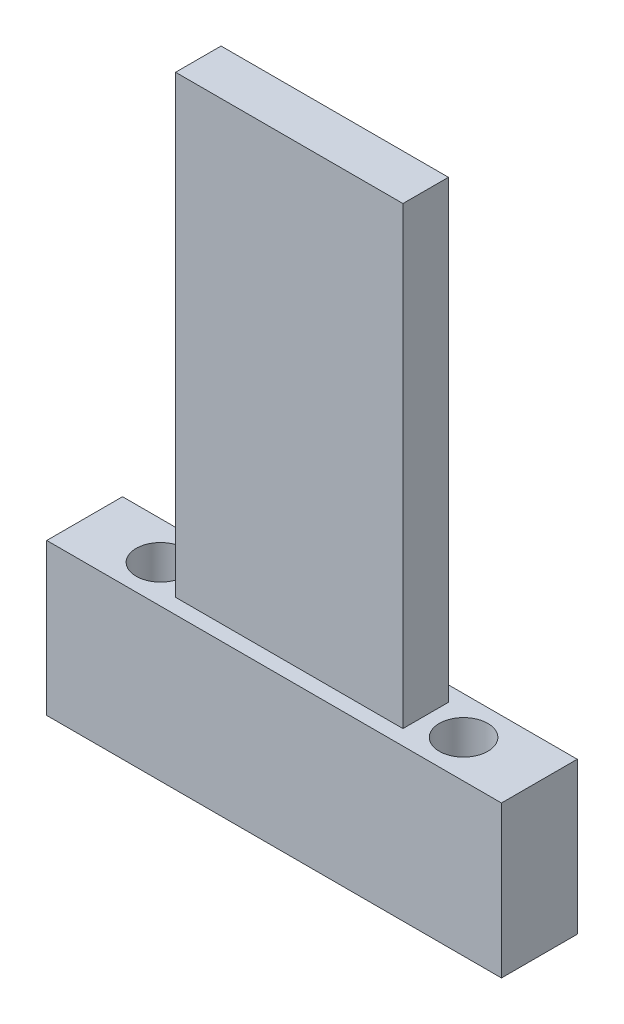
from build123d import *

# Parameters (mm, degrees)
ESBO_O1_W                = 30
ESBO_O1_H                = 5
RESSALTO_EXTRUS_O1_DEPTH = 10
ESBO_O2_W                = 15
ESBO_O2_H                = 3
RESSALTO_EXTRUS_O2_DEPTH = 30
ESBO_O3_R                = 1.6
CORTE_EXTRUS_O1_DEPTH    = 34.634060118


with BuildPart() as part:
    # Esbo_o1 → Ressalto-extrus_o1 (new body)
    with BuildSketch(Plane(origin=(0, 0, 0), x_dir=(1, 0, 0), z_dir=(0, 1, 0))):
        Rectangle(ESBO_O1_W, ESBO_O1_H)
    extrude(amount=RESSALTO_EXTRUS_O1_DEPTH)

    # Esbo_o2 → Ressalto-extrus_o2 (add)
    with BuildSketch(Plane(origin=(0, 10, 0), x_dir=(1, 0, 0), z_dir=(0, 1, 0))):
        Rectangle(ESBO_O2_W, ESBO_O2_H)
    extrude(amount=RESSALTO_EXTRUS_O2_DEPTH)

    # Esbo_o3 → Corte-extrus_o1 (cut, through all)
    with BuildSketch(Plane(origin=(0, 10, 0), x_dir=(1, 0, 0), z_dir=(0, 1, 0))):
        with Locations(Location((-10, 0, 0), (0, 0, 270))):
            Circle(ESBO_O3_R)
        with Locations(Location((10, 0, 0), (0, 0, 90))):
            Circle(ESBO_O3_R)
    extrude(amount=-CORTE_EXTRUS_O1_DEPTH, mode=Mode.SUBTRACT)


solid = part.part
